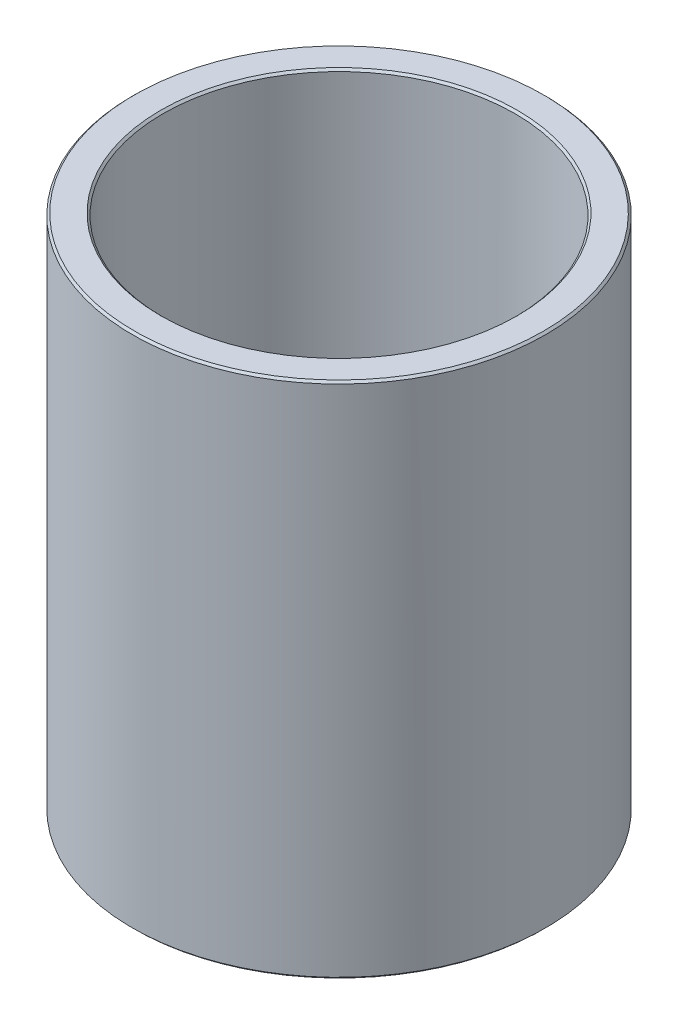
ISO-10303-21;
HEADER;
FILE_DESCRIPTION(('STEP AP214'),'2;1');
FILE_NAME('part.step','',(''),(''),'','','');
FILE_SCHEMA(('AUTOMOTIVE_DESIGN { 1 0 10303 214 1 1 1 1 }'));
ENDSEC;
DATA;
#1=APPLICATION_CONTEXT('core data for automotive mechanical design processes');
#2=APPLICATION_PROTOCOL_DEFINITION('international standard','automotive_design',2000,#1);
#3=PRODUCT_CONTEXT('',#1,'mechanical');
#4=PRODUCT('Part','Part','',(#3));
#5=PRODUCT_RELATED_PRODUCT_CATEGORY('part','',(#4));
#6=PRODUCT_DEFINITION_FORMATION('','',#4);
#7=PRODUCT_DEFINITION_CONTEXT('part definition',#1,'design');
#8=PRODUCT_DEFINITION('design','',#6,#7);
#9=PRODUCT_DEFINITION_SHAPE('','',#8);
#10=(LENGTH_UNIT() NAMED_UNIT(*) SI_UNIT(.MILLI.,.METRE.));
#11=(NAMED_UNIT(*) PLANE_ANGLE_UNIT() SI_UNIT($,.RADIAN.));
#12=(NAMED_UNIT(*) SI_UNIT($,.STERADIAN.) SOLID_ANGLE_UNIT());
#13=UNCERTAINTY_MEASURE_WITH_UNIT(LENGTH_MEASURE(1.E-05),#10,'distance_accuracy_value','');
#14=(GEOMETRIC_REPRESENTATION_CONTEXT(3) GLOBAL_UNCERTAINTY_ASSIGNED_CONTEXT((#13)) GLOBAL_UNIT_ASSIGNED_CONTEXT((#10,
#11,#12)) REPRESENTATION_CONTEXT('',''));
#15=CARTESIAN_POINT('',(0.,0.,0.));
#16=DIRECTION('',(0.,0.,1.));
#17=DIRECTION('',(1.,0.,0.));
#18=AXIS2_PLACEMENT_3D('',#15,#16,#17);
#19=CARTESIAN_POINT('',(0.,66.5925792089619,0.));
#20=DIRECTION('',(0.,1.,0.));
#21=DIRECTION('',(-1.,0.,0.));
#22=AXIS2_PLACEMENT_3D('',#19,#20,#21);
#23=CYLINDRICAL_SURFACE('',#22,17.);
#24=CARTESIAN_POINT('',(0.,49.8,0.));
#25=DIRECTION('',(0.,-1.,0.));
#26=DIRECTION('',(1.,0.,0.));
#27=AXIS2_PLACEMENT_3D('',#24,#25,#26);
#28=CIRCLE('',#27,17.);
#29=CARTESIAN_POINT('',(17.,49.8,0.));
#30=VERTEX_POINT('',#29);
#31=EDGE_CURVE('E58',#30,#30,#28,.F.);
#32=ORIENTED_EDGE('',*,*,#31,.T.);
#33=EDGE_LOOP('',(#32));
#34=FACE_BOUND('',#33,.T.);
#35=CARTESIAN_POINT('',(0.,0.199999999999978,0.));
#36=DIRECTION('',(0.,1.,0.));
#37=DIRECTION('',(-1.,0.,0.));
#38=AXIS2_PLACEMENT_3D('',#35,#36,#37);
#39=CIRCLE('',#38,17.);
#40=CARTESIAN_POINT('',(-17.,0.199999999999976,0.));
#41=VERTEX_POINT('',#40);
#42=EDGE_CURVE('E61',#41,#41,#39,.F.);
#43=ORIENTED_EDGE('',*,*,#42,.T.);
#44=EDGE_LOOP('',(#43));
#45=FACE_BOUND('',#44,.T.);
#46=ADVANCED_FACE('F32',(#34,#45),#23,.F.);
#47=CARTESIAN_POINT('',(17.,0.,0.));
#48=DIRECTION('',(0.,1.,0.));
#49=DIRECTION('',(-1.,0.,0.));
#50=AXIS2_PLACEMENT_3D('',#47,#48,#49);
#51=PLANE('',#50);
#52=CARTESIAN_POINT('',(0.,0.,0.));
#53=DIRECTION('',(0.,1.,0.));
#54=DIRECTION('',(-1.,0.,0.));
#55=AXIS2_PLACEMENT_3D('',#52,#53,#54);
#56=CIRCLE('',#55,17.2);
#57=CARTESIAN_POINT('',(-17.2,0.,0.));
#58=VERTEX_POINT('',#57);
#59=EDGE_CURVE('E43',#58,#58,#56,.T.);
#60=ORIENTED_EDGE('',*,*,#59,.T.);
#61=EDGE_LOOP('',(#60));
#62=FACE_BOUND('',#61,.T.);
#63=CARTESIAN_POINT('',(0.,0.,0.));
#64=DIRECTION('',(0.,1.,0.));
#65=DIRECTION('',(-1.,0.,0.));
#66=AXIS2_PLACEMENT_3D('',#63,#64,#65);
#67=CIRCLE('',#66,19.75);
#68=CARTESIAN_POINT('',(-19.75,0.,0.));
#69=VERTEX_POINT('',#68);
#70=EDGE_CURVE('E47',#69,#69,#67,.F.);
#71=ORIENTED_EDGE('',*,*,#70,.T.);
#72=EDGE_LOOP('',(#71));
#73=FACE_BOUND('',#72,.T.);
#74=ADVANCED_FACE('F74',(#62,#73),#51,.F.);
#75=CARTESIAN_POINT('',(0.,66.5925792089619,0.));
#76=DIRECTION('',(0.,1.,0.));
#77=DIRECTION('',(-1.,0.,0.));
#78=AXIS2_PLACEMENT_3D('',#75,#76,#77);
#79=CYLINDRICAL_SURFACE('',#78,19.95);
#80=CARTESIAN_POINT('',(0.,0.199999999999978,0.));
#81=DIRECTION('',(0.,1.,0.));
#82=DIRECTION('',(-1.,0.,0.));
#83=AXIS2_PLACEMENT_3D('',#80,#81,#82);
#84=CIRCLE('',#83,19.95);
#85=CARTESIAN_POINT('',(-19.95,0.199999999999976,0.));
#86=VERTEX_POINT('',#85);
#87=EDGE_CURVE('E10',#86,#86,#84,.T.);
#88=ORIENTED_EDGE('',*,*,#87,.T.);
#89=EDGE_LOOP('',(#88));
#90=FACE_BOUND('',#89,.T.);
#91=CARTESIAN_POINT('',(0.,49.8,0.));
#92=DIRECTION('',(0.,-1.,0.));
#93=DIRECTION('',(1.,0.,0.));
#94=AXIS2_PLACEMENT_3D('',#91,#92,#93);
#95=CIRCLE('',#94,19.95);
#96=CARTESIAN_POINT('',(19.95,49.8,0.));
#97=VERTEX_POINT('',#96);
#98=EDGE_CURVE('E39',#97,#97,#95,.T.);
#99=ORIENTED_EDGE('',*,*,#98,.T.);
#100=EDGE_LOOP('',(#99));
#101=FACE_BOUND('',#100,.T.);
#102=ADVANCED_FACE('F77',(#90,#101),#79,.T.);
#103=CARTESIAN_POINT('',(17.,50.,0.));
#104=DIRECTION('',(0.,-1.,0.));
#105=DIRECTION('',(1.,0.,0.));
#106=AXIS2_PLACEMENT_3D('',#103,#104,#105);
#107=PLANE('',#106);
#108=CARTESIAN_POINT('',(0.,50.,0.));
#109=DIRECTION('',(0.,-1.,0.));
#110=DIRECTION('',(1.,0.,0.));
#111=AXIS2_PLACEMENT_3D('',#108,#109,#110);
#112=CIRCLE('',#111,17.2);
#113=CARTESIAN_POINT('',(17.2,50.,0.));
#114=VERTEX_POINT('',#113);
#115=EDGE_CURVE('E52',#114,#114,#112,.T.);
#116=ORIENTED_EDGE('',*,*,#115,.T.);
#117=EDGE_LOOP('',(#116));
#118=FACE_BOUND('',#117,.T.);
#119=CARTESIAN_POINT('',(0.,50.,0.));
#120=DIRECTION('',(0.,-1.,0.));
#121=DIRECTION('',(1.,0.,0.));
#122=AXIS2_PLACEMENT_3D('',#119,#120,#121);
#123=CIRCLE('',#122,19.75);
#124=CARTESIAN_POINT('',(19.75,50.,0.));
#125=VERTEX_POINT('',#124);
#126=EDGE_CURVE('E55',#125,#125,#123,.F.);
#127=ORIENTED_EDGE('',*,*,#126,.T.);
#128=EDGE_LOOP('',(#127));
#129=FACE_BOUND('',#128,.T.);
#130=ADVANCED_FACE('F95',(#118,#129),#107,.F.);
#131=CARTESIAN_POINT('',(0.,49.8,0.));
#132=DIRECTION('',(0.,1.,0.));
#133=DIRECTION('',(-1.,0.,0.));
#134=AXIS2_PLACEMENT_3D('',#131,#132,#133);
#135=CONICAL_SURFACE('',#134,17.,0.785398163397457);
#136=ORIENTED_EDGE('',*,*,#115,.F.);
#137=EDGE_LOOP('',(#136));
#138=FACE_BOUND('',#137,.T.);
#139=ORIENTED_EDGE('',*,*,#31,.F.);
#140=EDGE_LOOP('',(#139));
#141=FACE_BOUND('',#140,.T.);
#142=ADVANCED_FACE('F70',(#138,#141),#135,.F.);
#143=CARTESIAN_POINT('',(0.,0.,0.));
#144=DIRECTION('',(0.,-1.,0.));
#145=DIRECTION('',(1.,0.,0.));
#146=AXIS2_PLACEMENT_3D('',#143,#144,#145);
#147=CONICAL_SURFACE('',#146,17.2,0.785398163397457);
#148=ORIENTED_EDGE('',*,*,#42,.F.);
#149=EDGE_LOOP('',(#148));
#150=FACE_BOUND('',#149,.T.);
#151=ORIENTED_EDGE('',*,*,#59,.F.);
#152=EDGE_LOOP('',(#151));
#153=FACE_BOUND('',#152,.T.);
#154=ADVANCED_FACE('F66',(#150,#153),#147,.F.);
#155=CARTESIAN_POINT('',(0.,0.199999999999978,0.));
#156=DIRECTION('',(0.,1.,0.));
#157=DIRECTION('',(-1.,0.,0.));
#158=AXIS2_PLACEMENT_3D('',#155,#156,#157);
#159=CONICAL_SURFACE('',#158,19.95,0.785398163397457);
#160=ORIENTED_EDGE('',*,*,#70,.F.);
#161=EDGE_LOOP('',(#160));
#162=FACE_BOUND('',#161,.T.);
#163=ORIENTED_EDGE('',*,*,#87,.F.);
#164=EDGE_LOOP('',(#163));
#165=FACE_BOUND('',#164,.T.);
#166=ADVANCED_FACE('F69',(#162,#165),#159,.T.);
#167=CARTESIAN_POINT('',(0.,50.,0.));
#168=DIRECTION('',(0.,-1.,0.));
#169=DIRECTION('',(1.,0.,0.));
#170=AXIS2_PLACEMENT_3D('',#167,#168,#169);
#171=CONICAL_SURFACE('',#170,19.75,0.785398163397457);
#172=CARTESIAN_POINT('',(19.95,49.8,0.));
#173=CARTESIAN_POINT('',(19.9479166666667,49.8020833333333,0.));
#174=CARTESIAN_POINT('',(19.9458333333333,49.8041666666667,0.));
#175=CARTESIAN_POINT('',(19.9416666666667,49.8083333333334,0.));
#176=CARTESIAN_POINT('',(19.9395833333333,49.8104166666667,0.));
#177=CARTESIAN_POINT('',(19.9354166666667,49.8145833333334,0.));
#178=CARTESIAN_POINT('',(19.9333333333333,49.8166666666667,0.));
#179=CARTESIAN_POINT('',(19.9291666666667,49.8208333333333,0.));
#180=CARTESIAN_POINT('',(19.9270833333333,49.8229166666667,0.));
#181=CARTESIAN_POINT('',(19.9229166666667,49.8270833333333,0.));
#182=CARTESIAN_POINT('',(19.9208333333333,49.8291666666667,0.));
#183=CARTESIAN_POINT('',(19.9166666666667,49.8333333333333,0.));
#184=CARTESIAN_POINT('',(19.9145833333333,49.8354166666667,0.));
#185=CARTESIAN_POINT('',(19.9104166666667,49.8395833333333,0.));
#186=CARTESIAN_POINT('',(19.9083333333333,49.8416666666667,0.));
#187=CARTESIAN_POINT('',(19.9041666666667,49.8458333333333,0.));
#188=CARTESIAN_POINT('',(19.9020833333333,49.8479166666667,0.));
#189=CARTESIAN_POINT('',(19.8979166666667,49.8520833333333,0.));
#190=CARTESIAN_POINT('',(19.8958333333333,49.8541666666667,0.));
#191=CARTESIAN_POINT('',(19.8916666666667,49.8583333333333,0.));
#192=CARTESIAN_POINT('',(19.8895833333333,49.8604166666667,0.));
#193=CARTESIAN_POINT('',(19.8854166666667,49.8645833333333,0.));
#194=CARTESIAN_POINT('',(19.8833333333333,49.8666666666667,0.));
#195=CARTESIAN_POINT('',(19.8791666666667,49.8708333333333,0.));
#196=CARTESIAN_POINT('',(19.8770833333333,49.8729166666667,0.));
#197=CARTESIAN_POINT('',(19.8729166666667,49.8770833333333,0.));
#198=CARTESIAN_POINT('',(19.8708333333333,49.8791666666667,0.));
#199=CARTESIAN_POINT('',(19.8666666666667,49.8833333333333,0.));
#200=CARTESIAN_POINT('',(19.8645833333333,49.8854166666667,0.));
#201=CARTESIAN_POINT('',(19.8604166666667,49.8895833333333,0.));
#202=CARTESIAN_POINT('',(19.8583333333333,49.8916666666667,0.));
#203=CARTESIAN_POINT('',(19.8541666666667,49.8958333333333,0.));
#204=CARTESIAN_POINT('',(19.8520833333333,49.8979166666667,0.));
#205=CARTESIAN_POINT('',(19.8479166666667,49.9020833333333,0.));
#206=CARTESIAN_POINT('',(19.8458333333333,49.9041666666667,0.));
#207=CARTESIAN_POINT('',(19.8416666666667,49.9083333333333,0.));
#208=CARTESIAN_POINT('',(19.8395833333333,49.9104166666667,0.));
#209=CARTESIAN_POINT('',(19.8354166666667,49.9145833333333,0.));
#210=CARTESIAN_POINT('',(19.8333333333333,49.9166666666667,0.));
#211=CARTESIAN_POINT('',(19.8291666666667,49.9208333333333,0.));
#212=CARTESIAN_POINT('',(19.8270833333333,49.9229166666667,0.));
#213=CARTESIAN_POINT('',(19.8229166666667,49.9270833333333,0.));
#214=CARTESIAN_POINT('',(19.8208333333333,49.9291666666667,0.));
#215=CARTESIAN_POINT('',(19.8166666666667,49.9333333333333,0.));
#216=CARTESIAN_POINT('',(19.8145833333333,49.9354166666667,0.));
#217=CARTESIAN_POINT('',(19.8104166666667,49.9395833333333,0.));
#218=CARTESIAN_POINT('',(19.8083333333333,49.9416666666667,0.));
#219=CARTESIAN_POINT('',(19.8041666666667,49.9458333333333,0.));
#220=CARTESIAN_POINT('',(19.8020833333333,49.9479166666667,0.));
#221=CARTESIAN_POINT('',(19.7979166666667,49.9520833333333,0.));
#222=CARTESIAN_POINT('',(19.7958333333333,49.9541666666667,0.));
#223=CARTESIAN_POINT('',(19.7916666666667,49.9583333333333,0.));
#224=CARTESIAN_POINT('',(19.7895833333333,49.9604166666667,0.));
#225=CARTESIAN_POINT('',(19.7854166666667,49.9645833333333,0.));
#226=CARTESIAN_POINT('',(19.7833333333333,49.9666666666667,0.));
#227=CARTESIAN_POINT('',(19.7791666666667,49.9708333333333,0.));
#228=CARTESIAN_POINT('',(19.7770833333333,49.9729166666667,0.));
#229=CARTESIAN_POINT('',(19.7729166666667,49.9770833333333,0.));
#230=CARTESIAN_POINT('',(19.7708333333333,49.9791666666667,0.));
#231=CARTESIAN_POINT('',(19.7666666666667,49.9833333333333,0.));
#232=CARTESIAN_POINT('',(19.7645833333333,49.9854166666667,0.));
#233=CARTESIAN_POINT('',(19.7604166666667,49.9895833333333,0.));
#234=CARTESIAN_POINT('',(19.7583333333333,49.9916666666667,0.));
#235=CARTESIAN_POINT('',(19.7541666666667,49.9958333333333,0.));
#236=CARTESIAN_POINT('',(19.7520833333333,49.9979166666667,0.));
#237=CARTESIAN_POINT('',(19.75,50.,0.));
#238=B_SPLINE_CURVE_WITH_KNOTS('',3,(#172,#173,#174,#175,#176,#177,#178,#179,#180,#181,#182,
#183,#184,#185,#186,#187,#188,#189,#190,#191,#192,#193,#194,#195,#196,#197,#198,#199,#200,#201,
#202,#203,#204,#205,#206,#207,#208,#209,#210,#211,#212,#213,#214,#215,#216,#217,#218,#219,#220,
#221,#222,#223,#224,#225,#226,#227,#228,#229,#230,#231,#232,#233,#234,#235,#236,#237),
.UNSPECIFIED.,.F.,.F.,(4,2,2,2,2,2,2,2,2,2,2,2,2,2,2,2,2,2,2,2,2,2,2,2,2,2,2,2,2,2,2,2,4),(0.,
0.00883883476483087,0.0176776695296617,0.0265165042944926,0.0353553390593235,0.0441941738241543,
0.0530330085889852,0.0618718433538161,0.070710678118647,0.0795495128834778,0.0883883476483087,
0.0972271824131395,0.10606601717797,0.114904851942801,0.123743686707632,0.132582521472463,
0.141421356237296,0.150260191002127,0.159099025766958,0.167937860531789,0.17677669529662,
0.185615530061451,0.194454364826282,0.203293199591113,0.212132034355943,0.220970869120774,
0.229809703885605,0.238648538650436,0.247487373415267,0.256326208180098,0.265165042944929,
0.27400387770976,0.282842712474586),.UNSPECIFIED.);
#239=EDGE_CURVE('BSEAM34',#97,#125,#238,.T.);
#240=ORIENTED_EDGE('',*,*,#98,.F.);
#241=ORIENTED_EDGE('',*,*,#126,.F.);
#242=ORIENTED_EDGE('',*,*,#239,.T.);
#243=ORIENTED_EDGE('',*,*,#239,.F.);
#244=EDGE_LOOP('',(#240,#242,#241,#243));
#245=FACE_BOUND('',#244,.T.);
#246=ADVANCED_FACE('F34',(#245),#171,.T.);
#247=CLOSED_SHELL('',(#46,#74,#102,#130,#142,#154,#166,#246));
#248=MANIFOLD_SOLID_BREP('B2',#247);
#249=ADVANCED_BREP_SHAPE_REPRESENTATION('',(#18,#248),#14);
#250=SHAPE_DEFINITION_REPRESENTATION(#9,#249);
ENDSEC;
END-ISO-10303-21;
